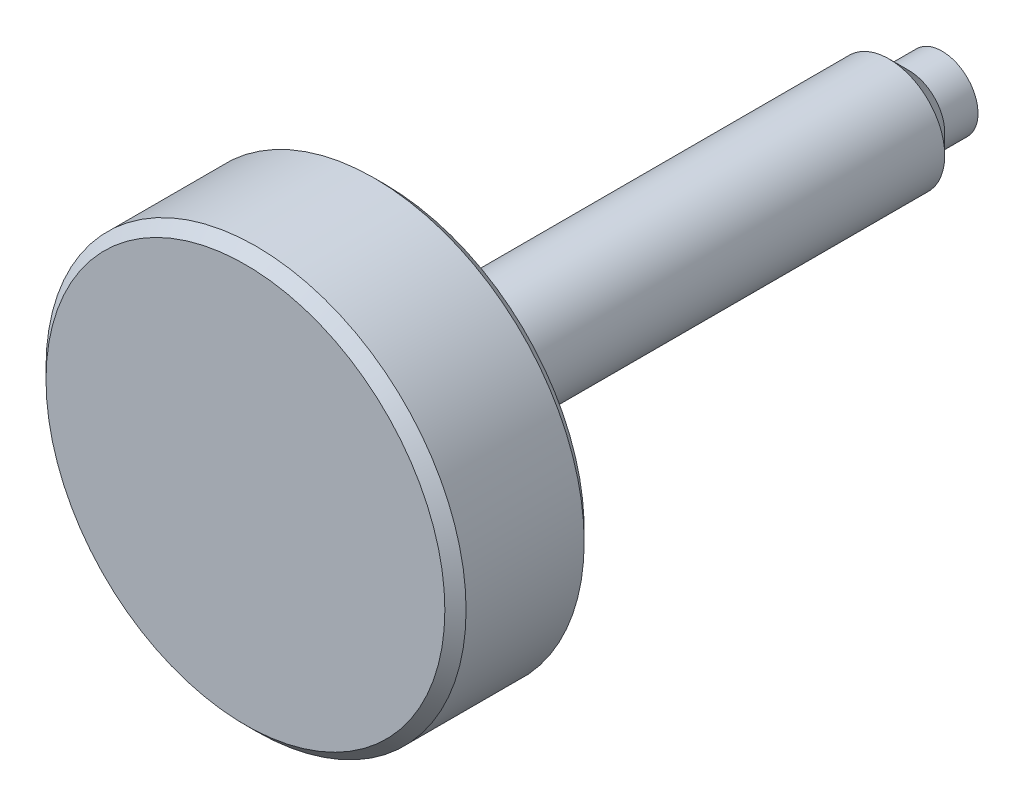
ISO-10303-21;
HEADER;
FILE_DESCRIPTION(('STEP AP214'),'2;1');
FILE_NAME('part.step','',(''),(''),'','','');
FILE_SCHEMA(('AUTOMOTIVE_DESIGN { 1 0 10303 214 1 1 1 1 }'));
ENDSEC;
DATA;
#1=APPLICATION_CONTEXT('core data for automotive mechanical design processes');
#2=APPLICATION_PROTOCOL_DEFINITION('international standard','automotive_design',2000,#1);
#3=PRODUCT_CONTEXT('',#1,'mechanical');
#4=PRODUCT('Part','Part','',(#3));
#5=PRODUCT_RELATED_PRODUCT_CATEGORY('part','',(#4));
#6=PRODUCT_DEFINITION_FORMATION('','',#4);
#7=PRODUCT_DEFINITION_CONTEXT('part definition',#1,'design');
#8=PRODUCT_DEFINITION('design','',#6,#7);
#9=PRODUCT_DEFINITION_SHAPE('','',#8);
#10=(LENGTH_UNIT() NAMED_UNIT(*) SI_UNIT(.MILLI.,.METRE.));
#11=(NAMED_UNIT(*) PLANE_ANGLE_UNIT() SI_UNIT($,.RADIAN.));
#12=(NAMED_UNIT(*) SI_UNIT($,.STERADIAN.) SOLID_ANGLE_UNIT());
#13=UNCERTAINTY_MEASURE_WITH_UNIT(LENGTH_MEASURE(1.E-05),#10,'distance_accuracy_value','');
#14=(GEOMETRIC_REPRESENTATION_CONTEXT(3) GLOBAL_UNCERTAINTY_ASSIGNED_CONTEXT((#13)) GLOBAL_UNIT_ASSIGNED_CONTEXT((#10,
#11,#12)) REPRESENTATION_CONTEXT('',''));
#15=CARTESIAN_POINT('',(0.,0.,0.));
#16=DIRECTION('',(0.,0.,1.));
#17=DIRECTION('',(1.,0.,0.));
#18=AXIS2_PLACEMENT_3D('',#15,#16,#17);
#19=CARTESIAN_POINT('',(14.4846548,-14.4846548,0.));
#20=DIRECTION('',(0.,0.,1.));
#21=DIRECTION('',(1.,0.,0.));
#22=AXIS2_PLACEMENT_3D('',#19,#20,#21);
#23=PLANE('',#22);
#24=CARTESIAN_POINT('',(0.,0.,0.));
#25=DIRECTION('',(0.,0.,1.));
#26=DIRECTION('',(0.,1.,0.));
#27=AXIS2_PLACEMENT_3D('',#24,#25,#26);
#28=CIRCLE('',#27,14.3129);
#29=CARTESIAN_POINT('',(0.,14.3129,0.));
#30=VERTEX_POINT('',#29);
#31=EDGE_CURVE('E35',#30,#30,#28,.T.);
#32=ORIENTED_EDGE('',*,*,#31,.F.);
#33=EDGE_LOOP('',(#32));
#34=FACE_BOUND('',#33,.T.);
#35=CARTESIAN_POINT('',(0.,0.,0.));
#36=DIRECTION('',(0.,0.,-1.));
#37=DIRECTION('',(-1.,0.,0.));
#38=AXIS2_PLACEMENT_3D('',#35,#36,#37);
#39=CIRCLE('',#38,4.);
#40=CARTESIAN_POINT('',(-4.,0.,0.));
#41=VERTEX_POINT('',#40);
#42=EDGE_CURVE('E43',#41,#41,#39,.T.);
#43=ORIENTED_EDGE('',*,*,#42,.F.);
#44=EDGE_LOOP('',(#43));
#45=FACE_BOUND('',#44,.T.);
#46=ADVANCED_FACE('F12',(#34,#45),#23,.F.);
#47=CARTESIAN_POINT('',(0.,0.,0.762));
#48=DIRECTION('',(0.,0.,1.));
#49=DIRECTION('',(0.,1.,0.));
#50=AXIS2_PLACEMENT_3D('',#47,#48,#49);
#51=CONICAL_SURFACE('',#50,15.0749,0.785398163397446);
#52=ORIENTED_EDGE('',*,*,#31,.T.);
#53=EDGE_LOOP('',(#52));
#54=FACE_BOUND('',#53,.T.);
#55=CARTESIAN_POINT('',(0.,0.,0.762));
#56=DIRECTION('',(0.,0.,-1.));
#57=DIRECTION('',(-1.,0.,0.));
#58=AXIS2_PLACEMENT_3D('',#55,#56,#57);
#59=CIRCLE('',#58,15.0749);
#60=CARTESIAN_POINT('',(-15.0749,0.,0.762));
#61=VERTEX_POINT('',#60);
#62=EDGE_CURVE('E25',#61,#61,#59,.F.);
#63=ORIENTED_EDGE('',*,*,#62,.F.);
#64=EDGE_LOOP('',(#63));
#65=FACE_BOUND('',#64,.T.);
#66=ADVANCED_FACE('F55',(#54,#65),#51,.T.);
#67=CARTESIAN_POINT('',(14.4846548,14.4846548,9.99998));
#68=DIRECTION('',(0.,0.,-1.));
#69=DIRECTION('',(-1.,0.,0.));
#70=AXIS2_PLACEMENT_3D('',#67,#68,#69);
#71=PLANE('',#70);
#72=CARTESIAN_POINT('',(0.,0.,9.99998));
#73=DIRECTION('',(0.,0.,-1.));
#74=DIRECTION('',(-1.,0.,0.));
#75=AXIS2_PLACEMENT_3D('',#72,#73,#74);
#76=CIRCLE('',#75,14.3129);
#77=CARTESIAN_POINT('',(-14.3129,0.,9.99998));
#78=VERTEX_POINT('',#77);
#79=EDGE_CURVE('E20',#78,#78,#76,.T.);
#80=ORIENTED_EDGE('',*,*,#79,.F.);
#81=EDGE_LOOP('',(#80));
#82=FACE_BOUND('',#81,.T.);
#83=ADVANCED_FACE('F57',(#82),#71,.F.);
#84=CARTESIAN_POINT('',(0.,0.,0.762));
#85=DIRECTION('',(0.,0.,-1.));
#86=DIRECTION('',(0.,-1.,0.));
#87=AXIS2_PLACEMENT_3D('',#84,#85,#86);
#88=CYLINDRICAL_SURFACE('',#87,15.0749);
#89=CARTESIAN_POINT('',(0.,0.,9.23798));
#90=DIRECTION('',(0.,0.,-1.));
#91=DIRECTION('',(0.,-1.,0.));
#92=AXIS2_PLACEMENT_3D('',#89,#90,#91);
#93=CIRCLE('',#92,15.0749);
#94=CARTESIAN_POINT('',(0.,-15.0749,9.23797999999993));
#95=VERTEX_POINT('',#94);
#96=EDGE_CURVE('E8',#95,#95,#93,.F.);
#97=ORIENTED_EDGE('',*,*,#96,.F.);
#98=EDGE_LOOP('',(#97));
#99=FACE_BOUND('',#98,.T.);
#100=ORIENTED_EDGE('',*,*,#62,.T.);
#101=EDGE_LOOP('',(#100));
#102=FACE_BOUND('',#101,.T.);
#103=ADVANCED_FACE('F53',(#99,#102),#88,.T.);
#104=CARTESIAN_POINT('',(0.,0.,9.23798));
#105=DIRECTION('',(0.,0.,-1.));
#106=DIRECTION('',(-1.,0.,0.));
#107=AXIS2_PLACEMENT_3D('',#104,#105,#106);
#108=CONICAL_SURFACE('',#107,15.0749,0.785398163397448);
#109=ORIENTED_EDGE('',*,*,#79,.T.);
#110=EDGE_LOOP('',(#109));
#111=FACE_BOUND('',#110,.T.);
#112=ORIENTED_EDGE('',*,*,#96,.T.);
#113=EDGE_LOOP('',(#112));
#114=FACE_BOUND('',#113,.T.);
#115=ADVANCED_FACE('F14',(#111,#114),#108,.T.);
#116=CARTESIAN_POINT('',(0.,0.,-39.99992));
#117=DIRECTION('',(0.,0.,1.));
#118=DIRECTION('',(1.,0.,0.));
#119=AXIS2_PLACEMENT_3D('',#116,#117,#118);
#120=CYLINDRICAL_SURFACE('',#119,4.);
#121=CARTESIAN_POINT('',(0.,0.,-36.19042));
#122=DIRECTION('',(0.,0.,1.));
#123=DIRECTION('',(1.,0.,0.));
#124=AXIS2_PLACEMENT_3D('',#121,#122,#123);
#125=CIRCLE('',#124,4.);
#126=CARTESIAN_POINT('',(4.,0.,-36.19042));
#127=VERTEX_POINT('',#126);
#128=EDGE_CURVE('E16',#127,#127,#125,.T.);
#129=ORIENTED_EDGE('',*,*,#128,.T.);
#130=EDGE_LOOP('',(#129));
#131=FACE_BOUND('',#130,.T.);
#132=ORIENTED_EDGE('',*,*,#42,.T.);
#133=EDGE_LOOP('',(#132));
#134=FACE_BOUND('',#133,.T.);
#135=ADVANCED_FACE('F70',(#131,#134),#120,.T.);
#136=CARTESIAN_POINT('',(2.6090372,-2.6090372,-39.99992));
#137=DIRECTION('',(0.,0.,1.));
#138=DIRECTION('',(1.,0.,0.));
#139=AXIS2_PLACEMENT_3D('',#136,#137,#138);
#140=PLANE('',#139);
#141=CARTESIAN_POINT('',(0.,0.,-39.99992));
#142=DIRECTION('',(0.,0.,-1.));
#143=DIRECTION('',(0.,-1.,0.));
#144=AXIS2_PLACEMENT_3D('',#141,#142,#143);
#145=CIRCLE('',#144,2.5781);
#146=CARTESIAN_POINT('',(0.,-2.5781,-39.99992));
#147=VERTEX_POINT('',#146);
#148=EDGE_CURVE('E36',#147,#147,#145,.F.);
#149=ORIENTED_EDGE('',*,*,#148,.F.);
#150=EDGE_LOOP('',(#149));
#151=FACE_BOUND('',#150,.T.);
#152=ADVANCED_FACE('F78',(#151),#140,.F.);
#153=CARTESIAN_POINT('',(0.,0.,-39.99992));
#154=DIRECTION('',(0.,0.,-1.));
#155=DIRECTION('',(0.,-1.,0.));
#156=AXIS2_PLACEMENT_3D('',#153,#154,#155);
#157=CYLINDRICAL_SURFACE('',#156,2.5781);
#158=ORIENTED_EDGE('',*,*,#148,.T.);
#159=EDGE_LOOP('',(#158));
#160=FACE_BOUND('',#159,.T.);
#161=CARTESIAN_POINT('',(0.,0.,-37.61232));
#162=DIRECTION('',(0.,0.,1.));
#163=DIRECTION('',(1.,0.,0.));
#164=AXIS2_PLACEMENT_3D('',#161,#162,#163);
#165=CIRCLE('',#164,2.5781);
#166=CARTESIAN_POINT('',(2.5781,0.,-37.6123199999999));
#167=VERTEX_POINT('',#166);
#168=EDGE_CURVE('E33',#167,#167,#165,.T.);
#169=ORIENTED_EDGE('',*,*,#168,.F.);
#170=EDGE_LOOP('',(#169));
#171=FACE_BOUND('',#170,.T.);
#172=ADVANCED_FACE('F122',(#160,#171),#157,.T.);
#173=CARTESIAN_POINT('',(0.,0.,-36.18992));
#174=DIRECTION('',(0.,0.,1.));
#175=DIRECTION('',(1.,0.,0.));
#176=AXIS2_PLACEMENT_3D('',#173,#174,#175);
#177=CONICAL_SURFACE('',#176,4.0005,0.785398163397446);
#178=ORIENTED_EDGE('',*,*,#128,.F.);
#179=EDGE_LOOP('',(#178));
#180=FACE_BOUND('',#179,.T.);
#181=ORIENTED_EDGE('',*,*,#168,.T.);
#182=EDGE_LOOP('',(#181));
#183=FACE_BOUND('',#182,.T.);
#184=ADVANCED_FACE('F130',(#180,#183),#177,.T.);
#185=CLOSED_SHELL('',(#46,#66,#83,#103,#115,#135,#152,#172,#184));
#186=MANIFOLD_SOLID_BREP('B1',#185);
#187=ADVANCED_BREP_SHAPE_REPRESENTATION('',(#18,#186),#14);
#188=SHAPE_DEFINITION_REPRESENTATION(#9,#187);
ENDSEC;
END-ISO-10303-21;
